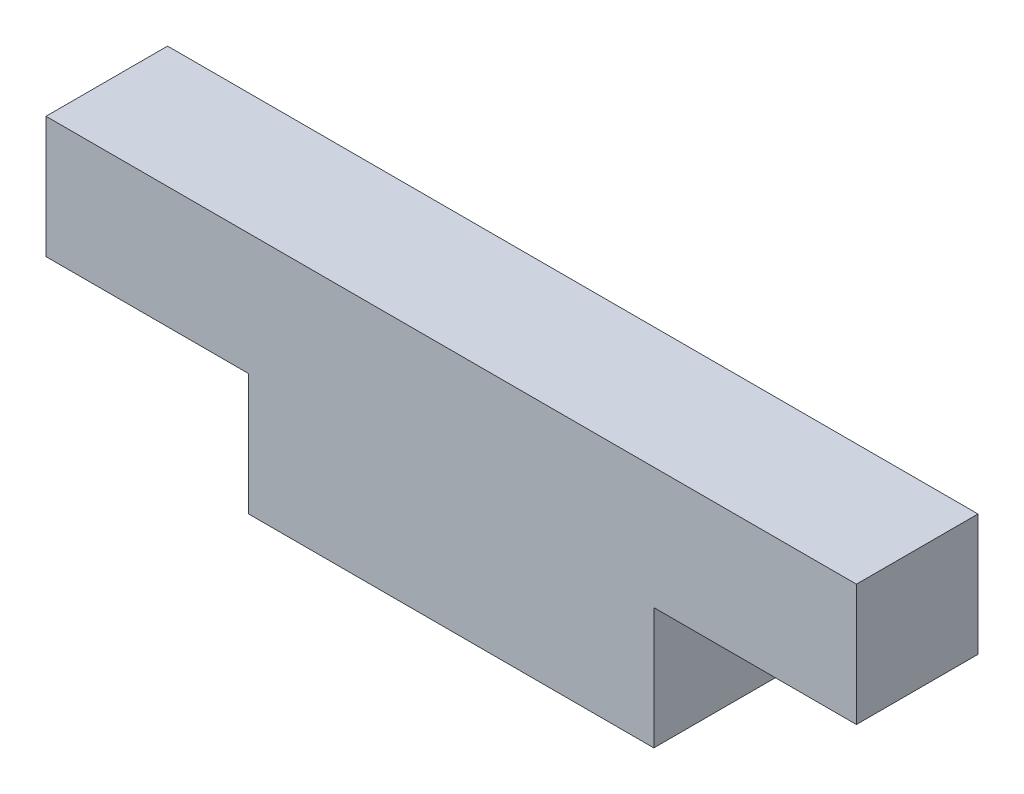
ISO-10303-21;
HEADER;
FILE_DESCRIPTION(('STEP AP214'),'2;1');
FILE_NAME('part.step','',(''),(''),'','','');
FILE_SCHEMA(('AUTOMOTIVE_DESIGN { 1 0 10303 214 1 1 1 1 }'));
ENDSEC;
DATA;
#1=APPLICATION_CONTEXT('core data for automotive mechanical design processes');
#2=APPLICATION_PROTOCOL_DEFINITION('international standard','automotive_design',2000,#1);
#3=PRODUCT_CONTEXT('',#1,'mechanical');
#4=PRODUCT('Part','Part','',(#3));
#5=PRODUCT_RELATED_PRODUCT_CATEGORY('part','',(#4));
#6=PRODUCT_DEFINITION_FORMATION('','',#4);
#7=PRODUCT_DEFINITION_CONTEXT('part definition',#1,'design');
#8=PRODUCT_DEFINITION('design','',#6,#7);
#9=PRODUCT_DEFINITION_SHAPE('','',#8);
#10=(LENGTH_UNIT() NAMED_UNIT(*) SI_UNIT(.MILLI.,.METRE.));
#11=(NAMED_UNIT(*) PLANE_ANGLE_UNIT() SI_UNIT($,.RADIAN.));
#12=(NAMED_UNIT(*) SI_UNIT($,.STERADIAN.) SOLID_ANGLE_UNIT());
#13=UNCERTAINTY_MEASURE_WITH_UNIT(LENGTH_MEASURE(1.E-05),#10,'distance_accuracy_value','');
#14=(GEOMETRIC_REPRESENTATION_CONTEXT(3) GLOBAL_UNCERTAINTY_ASSIGNED_CONTEXT((#13)) GLOBAL_UNIT_ASSIGNED_CONTEXT((#10,
#11,#12)) REPRESENTATION_CONTEXT('',''));
#15=CARTESIAN_POINT('',(0.,0.,0.));
#16=DIRECTION('',(0.,0.,1.));
#17=DIRECTION('',(1.,0.,0.));
#18=AXIS2_PLACEMENT_3D('',#15,#16,#17);
#19=CARTESIAN_POINT('',(0.,0.,3.));
#20=DIRECTION('',(0.,1.,0.));
#21=DIRECTION('',(0.,0.,1.));
#22=AXIS2_PLACEMENT_3D('',#19,#20,#21);
#23=PLANE('',#22);
#24=DIRECTION('',(1.,0.,0.));
#25=VECTOR('',#24,1.);
#26=CARTESIAN_POINT('',(0.,0.,0.));
#27=LINE('',#26,#25);
#28=CARTESIAN_POINT('',(-5.,0.,0.));
#29=VERTEX_POINT('',#28);
#30=CARTESIAN_POINT('',(5.,0.,0.));
#31=VERTEX_POINT('',#30);
#32=EDGE_CURVE('E120',#29,#31,#27,.T.);
#33=ORIENTED_EDGE('',*,*,#32,.T.);
#34=DIRECTION('',(0.,0.,-1.));
#35=VECTOR('',#34,1.);
#36=CARTESIAN_POINT('',(5.,0.,3.));
#37=LINE('',#36,#35);
#38=CARTESIAN_POINT('',(5.,0.,3.));
#39=VERTEX_POINT('',#38);
#40=EDGE_CURVE('E118',#39,#31,#37,.T.);
#41=ORIENTED_EDGE('',*,*,#40,.F.);
#42=DIRECTION('',(1.,0.,0.));
#43=VECTOR('',#42,1.);
#44=CARTESIAN_POINT('',(0.,0.,3.));
#45=LINE('',#44,#43);
#46=CARTESIAN_POINT('',(-5.,0.,3.));
#47=VERTEX_POINT('',#46);
#48=EDGE_CURVE('E108',#47,#39,#45,.T.);
#49=ORIENTED_EDGE('',*,*,#48,.F.);
#50=DIRECTION('',(0.,0.,-1.));
#51=VECTOR('',#50,1.);
#52=CARTESIAN_POINT('',(-5.,0.,3.));
#53=LINE('',#52,#51);
#54=EDGE_CURVE('E154',#47,#29,#53,.T.);
#55=ORIENTED_EDGE('',*,*,#54,.T.);
#56=EDGE_LOOP('',(#33,#41,#49,#55));
#57=FACE_BOUND('',#56,.T.);
#58=ADVANCED_FACE('F36',(#57),#23,.F.);
#59=CARTESIAN_POINT('',(-10.,6.,3.));
#60=DIRECTION('',(0.,-1.,0.));
#61=DIRECTION('',(1.,0.,0.));
#62=AXIS2_PLACEMENT_3D('',#59,#60,#61);
#63=PLANE('',#62);
#64=DIRECTION('',(-1.,0.,0.));
#65=VECTOR('',#64,1.);
#66=CARTESIAN_POINT('',(-10.,6.,0.));
#67=LINE('',#66,#65);
#68=CARTESIAN_POINT('',(10.,6.,0.));
#69=VERTEX_POINT('',#68);
#70=CARTESIAN_POINT('',(-10.,6.,0.));
#71=VERTEX_POINT('',#70);
#72=EDGE_CURVE('E156',#69,#71,#67,.T.);
#73=ORIENTED_EDGE('',*,*,#72,.T.);
#74=DIRECTION('',(0.,0.,-1.));
#75=VECTOR('',#74,1.);
#76=CARTESIAN_POINT('',(-10.,6.,3.));
#77=LINE('',#76,#75);
#78=CARTESIAN_POINT('',(-10.,6.,3.));
#79=VERTEX_POINT('',#78);
#80=EDGE_CURVE('E11',#79,#71,#77,.T.);
#81=ORIENTED_EDGE('',*,*,#80,.F.);
#82=DIRECTION('',(-1.,0.,0.));
#83=VECTOR('',#82,1.);
#84=CARTESIAN_POINT('',(-10.,6.,3.));
#85=LINE('',#84,#83);
#86=CARTESIAN_POINT('',(10.,6.,3.));
#87=VERTEX_POINT('',#86);
#88=EDGE_CURVE('E83',#87,#79,#85,.T.);
#89=ORIENTED_EDGE('',*,*,#88,.F.);
#90=DIRECTION('',(0.,0.,-1.));
#91=VECTOR('',#90,1.);
#92=CARTESIAN_POINT('',(10.,6.,3.));
#93=LINE('',#92,#91);
#94=EDGE_CURVE('E138',#87,#69,#93,.T.);
#95=ORIENTED_EDGE('',*,*,#94,.T.);
#96=EDGE_LOOP('',(#73,#81,#89,#95));
#97=FACE_BOUND('',#96,.T.);
#98=ADVANCED_FACE('F180',(#97),#63,.F.);
#99=CARTESIAN_POINT('',(-10.,3.,3.));
#100=DIRECTION('',(1.,0.,0.));
#101=DIRECTION('',(0.,0.,-1.));
#102=AXIS2_PLACEMENT_3D('',#99,#100,#101);
#103=PLANE('',#102);
#104=DIRECTION('',(0.,-1.,0.));
#105=VECTOR('',#104,1.);
#106=CARTESIAN_POINT('',(-10.,3.,0.));
#107=LINE('',#106,#105);
#108=CARTESIAN_POINT('',(-10.,3.,0.));
#109=VERTEX_POINT('',#108);
#110=EDGE_CURVE('E158',#71,#109,#107,.T.);
#111=ORIENTED_EDGE('',*,*,#110,.T.);
#112=DIRECTION('',(0.,0.,-1.));
#113=VECTOR('',#112,1.);
#114=CARTESIAN_POINT('',(-10.,3.,3.));
#115=LINE('',#114,#113);
#116=CARTESIAN_POINT('',(-10.,3.,3.));
#117=VERTEX_POINT('',#116);
#118=EDGE_CURVE('E44',#117,#109,#115,.T.);
#119=ORIENTED_EDGE('',*,*,#118,.F.);
#120=DIRECTION('',(0.,-1.,0.));
#121=VECTOR('',#120,1.);
#122=CARTESIAN_POINT('',(-10.,3.,3.));
#123=LINE('',#122,#121);
#124=EDGE_CURVE('E149',#79,#117,#123,.T.);
#125=ORIENTED_EDGE('',*,*,#124,.F.);
#126=ORIENTED_EDGE('',*,*,#80,.T.);
#127=EDGE_LOOP('',(#111,#119,#125,#126));
#128=FACE_BOUND('',#127,.T.);
#129=ADVANCED_FACE('F181',(#128),#103,.F.);
#130=CARTESIAN_POINT('',(-5.,3.,3.));
#131=DIRECTION('',(0.,1.,0.));
#132=DIRECTION('',(0.,0.,1.));
#133=AXIS2_PLACEMENT_3D('',#130,#131,#132);
#134=PLANE('',#133);
#135=DIRECTION('',(1.,0.,0.));
#136=VECTOR('',#135,1.);
#137=CARTESIAN_POINT('',(-5.,3.,0.));
#138=LINE('',#137,#136);
#139=CARTESIAN_POINT('',(-5.,3.,0.));
#140=VERTEX_POINT('',#139);
#141=EDGE_CURVE('E70',#109,#140,#138,.T.);
#142=ORIENTED_EDGE('',*,*,#141,.T.);
#143=DIRECTION('',(0.,0.,-1.));
#144=VECTOR('',#143,1.);
#145=CARTESIAN_POINT('',(-5.,3.,3.));
#146=LINE('',#145,#144);
#147=CARTESIAN_POINT('',(-5.,3.,3.));
#148=VERTEX_POINT('',#147);
#149=EDGE_CURVE('E163',#148,#140,#146,.T.);
#150=ORIENTED_EDGE('',*,*,#149,.F.);
#151=DIRECTION('',(1.,0.,0.));
#152=VECTOR('',#151,1.);
#153=CARTESIAN_POINT('',(-5.,3.,3.));
#154=LINE('',#153,#152);
#155=EDGE_CURVE('E151',#117,#148,#154,.T.);
#156=ORIENTED_EDGE('',*,*,#155,.F.);
#157=ORIENTED_EDGE('',*,*,#118,.T.);
#158=EDGE_LOOP('',(#142,#150,#156,#157));
#159=FACE_BOUND('',#158,.T.);
#160=ADVANCED_FACE('F166',(#159),#134,.F.);
#161=CARTESIAN_POINT('',(-5.,0.,3.));
#162=DIRECTION('',(1.,0.,0.));
#163=DIRECTION('',(0.,0.,-1.));
#164=AXIS2_PLACEMENT_3D('',#161,#162,#163);
#165=PLANE('',#164);
#166=DIRECTION('',(0.,-1.,0.));
#167=VECTOR('',#166,1.);
#168=CARTESIAN_POINT('',(-5.,0.,0.));
#169=LINE('',#168,#167);
#170=EDGE_CURVE('E76',#140,#29,#169,.T.);
#171=ORIENTED_EDGE('',*,*,#170,.T.);
#172=ORIENTED_EDGE('',*,*,#54,.F.);
#173=DIRECTION('',(0.,-1.,0.));
#174=VECTOR('',#173,1.);
#175=CARTESIAN_POINT('',(-5.,0.,3.));
#176=LINE('',#175,#174);
#177=EDGE_CURVE('E52',#148,#47,#176,.T.);
#178=ORIENTED_EDGE('',*,*,#177,.F.);
#179=ORIENTED_EDGE('',*,*,#149,.T.);
#180=EDGE_LOOP('',(#171,#172,#178,#179));
#181=FACE_BOUND('',#180,.T.);
#182=ADVANCED_FACE('F182',(#181),#165,.F.);
#183=CARTESIAN_POINT('',(0.,0.,3.));
#184=DIRECTION('',(0.,0.,-1.));
#185=DIRECTION('',(-1.,0.,0.));
#186=AXIS2_PLACEMENT_3D('',#183,#184,#185);
#187=PLANE('',#186);
#188=ORIENTED_EDGE('',*,*,#48,.T.);
#189=DIRECTION('',(0.,-1.,0.));
#190=VECTOR('',#189,1.);
#191=CARTESIAN_POINT('',(5.,0.,3.));
#192=LINE('',#191,#190);
#193=CARTESIAN_POINT('',(5.,3.,3.));
#194=VERTEX_POINT('',#193);
#195=EDGE_CURVE('E113',#194,#39,#192,.T.);
#196=ORIENTED_EDGE('',*,*,#195,.F.);
#197=DIRECTION('',(-1.,0.,0.));
#198=VECTOR('',#197,1.);
#199=CARTESIAN_POINT('',(5.,3.,3.));
#200=LINE('',#199,#198);
#201=CARTESIAN_POINT('',(10.,3.,3.));
#202=VERTEX_POINT('',#201);
#203=EDGE_CURVE('E127',#202,#194,#200,.T.);
#204=ORIENTED_EDGE('',*,*,#203,.F.);
#205=DIRECTION('',(0.,-1.,0.));
#206=VECTOR('',#205,1.);
#207=CARTESIAN_POINT('',(10.,3.,3.));
#208=LINE('',#207,#206);
#209=EDGE_CURVE('E130',#87,#202,#208,.T.);
#210=ORIENTED_EDGE('',*,*,#209,.F.);
#211=ORIENTED_EDGE('',*,*,#88,.T.);
#212=ORIENTED_EDGE('',*,*,#124,.T.);
#213=ORIENTED_EDGE('',*,*,#155,.T.);
#214=ORIENTED_EDGE('',*,*,#177,.T.);
#215=EDGE_LOOP('',(#188,#196,#204,#210,#211,#212,#213,#214));
#216=FACE_BOUND('',#215,.T.);
#217=ADVANCED_FACE('F110',(#216),#187,.F.);
#218=CARTESIAN_POINT('',(0.,0.,0.));
#219=DIRECTION('',(0.,0.,-1.));
#220=DIRECTION('',(-1.,0.,0.));
#221=AXIS2_PLACEMENT_3D('',#218,#219,#220);
#222=PLANE('',#221);
#223=ORIENTED_EDGE('',*,*,#32,.F.);
#224=ORIENTED_EDGE('',*,*,#170,.F.);
#225=ORIENTED_EDGE('',*,*,#141,.F.);
#226=ORIENTED_EDGE('',*,*,#110,.F.);
#227=ORIENTED_EDGE('',*,*,#72,.F.);
#228=DIRECTION('',(0.,-1.,0.));
#229=VECTOR('',#228,1.);
#230=CARTESIAN_POINT('',(10.,3.,0.));
#231=LINE('',#230,#229);
#232=CARTESIAN_POINT('',(10.,3.,0.));
#233=VERTEX_POINT('',#232);
#234=EDGE_CURVE('E128',#69,#233,#231,.T.);
#235=ORIENTED_EDGE('',*,*,#234,.T.);
#236=DIRECTION('',(-1.,0.,0.));
#237=VECTOR('',#236,1.);
#238=CARTESIAN_POINT('',(5.,3.,0.));
#239=LINE('',#238,#237);
#240=CARTESIAN_POINT('',(5.,3.,0.));
#241=VERTEX_POINT('',#240);
#242=EDGE_CURVE('E133',#233,#241,#239,.T.);
#243=ORIENTED_EDGE('',*,*,#242,.T.);
#244=DIRECTION('',(0.,-1.,0.));
#245=VECTOR('',#244,1.);
#246=CARTESIAN_POINT('',(5.,0.,0.));
#247=LINE('',#246,#245);
#248=EDGE_CURVE('E139',#241,#31,#247,.T.);
#249=ORIENTED_EDGE('',*,*,#248,.T.);
#250=EDGE_LOOP('',(#223,#224,#225,#226,#227,#235,#243,#249));
#251=FACE_BOUND('',#250,.T.);
#252=ADVANCED_FACE('F171',(#251),#222,.T.);
#253=CARTESIAN_POINT('',(5.,0.,3.));
#254=DIRECTION('',(1.,0.,0.));
#255=DIRECTION('',(0.,0.,-1.));
#256=AXIS2_PLACEMENT_3D('',#253,#254,#255);
#257=PLANE('',#256);
#258=ORIENTED_EDGE('',*,*,#248,.F.);
#259=DIRECTION('',(0.,0.,-1.));
#260=VECTOR('',#259,1.);
#261=CARTESIAN_POINT('',(5.,3.,3.));
#262=LINE('',#261,#260);
#263=EDGE_CURVE('E124',#194,#241,#262,.T.);
#264=ORIENTED_EDGE('',*,*,#263,.F.);
#265=ORIENTED_EDGE('',*,*,#195,.T.);
#266=ORIENTED_EDGE('',*,*,#40,.T.);
#267=EDGE_LOOP('',(#258,#264,#265,#266));
#268=FACE_BOUND('',#267,.T.);
#269=ADVANCED_FACE('F126',(#268),#257,.T.);
#270=CARTESIAN_POINT('',(5.,3.,3.));
#271=DIRECTION('',(0.,-1.,0.));
#272=DIRECTION('',(0.,0.,-1.));
#273=AXIS2_PLACEMENT_3D('',#270,#271,#272);
#274=PLANE('',#273);
#275=ORIENTED_EDGE('',*,*,#242,.F.);
#276=DIRECTION('',(0.,0.,-1.));
#277=VECTOR('',#276,1.);
#278=CARTESIAN_POINT('',(10.,3.,3.));
#279=LINE('',#278,#277);
#280=EDGE_CURVE('E145',#202,#233,#279,.T.);
#281=ORIENTED_EDGE('',*,*,#280,.F.);
#282=ORIENTED_EDGE('',*,*,#203,.T.);
#283=ORIENTED_EDGE('',*,*,#263,.T.);
#284=EDGE_LOOP('',(#275,#281,#282,#283));
#285=FACE_BOUND('',#284,.T.);
#286=ADVANCED_FACE('F175',(#285),#274,.T.);
#287=CARTESIAN_POINT('',(10.,3.,3.));
#288=DIRECTION('',(1.,0.,0.));
#289=DIRECTION('',(0.,0.,-1.));
#290=AXIS2_PLACEMENT_3D('',#287,#288,#289);
#291=PLANE('',#290);
#292=ORIENTED_EDGE('',*,*,#234,.F.);
#293=ORIENTED_EDGE('',*,*,#94,.F.);
#294=ORIENTED_EDGE('',*,*,#209,.T.);
#295=ORIENTED_EDGE('',*,*,#280,.T.);
#296=EDGE_LOOP('',(#292,#293,#294,#295));
#297=FACE_BOUND('',#296,.T.);
#298=ADVANCED_FACE('F178',(#297),#291,.T.);
#299=CLOSED_SHELL('',(#58,#98,#129,#160,#182,#217,#252,#269,#286,#298));
#300=MANIFOLD_SOLID_BREP('B2',#299);
#301=ADVANCED_BREP_SHAPE_REPRESENTATION('',(#18,#300),#14);
#302=SHAPE_DEFINITION_REPRESENTATION(#9,#301);
ENDSEC;
END-ISO-10303-21;
